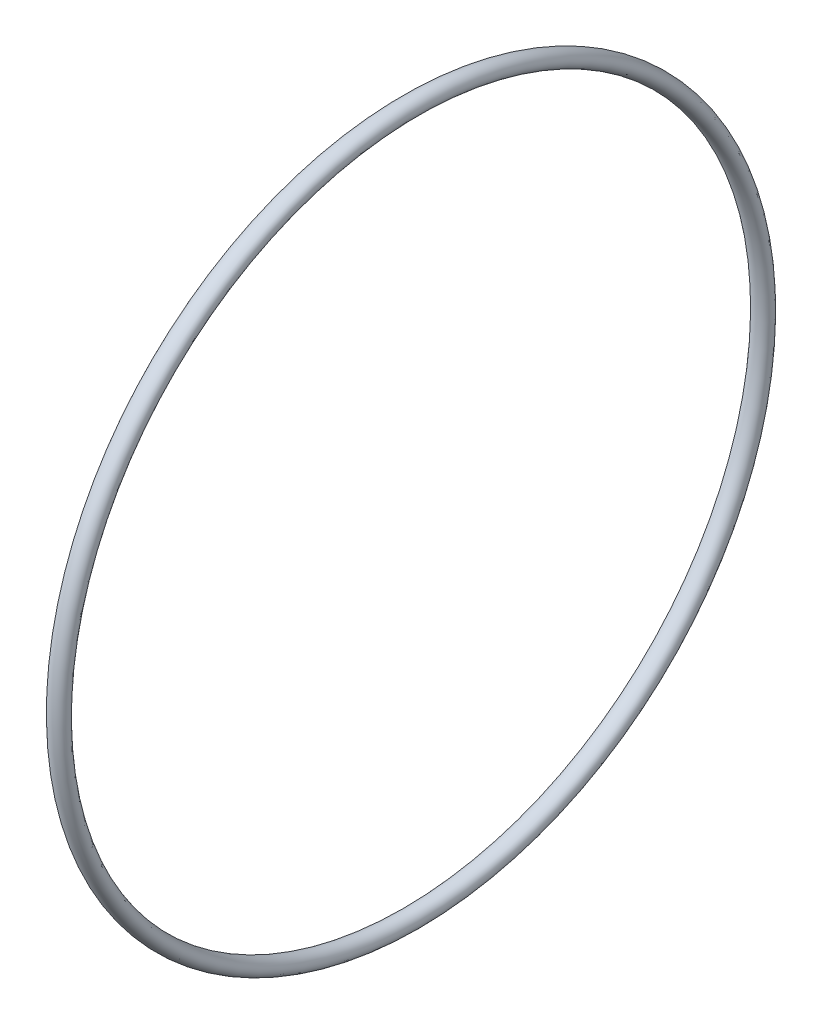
ISO-10303-21;
HEADER;
FILE_DESCRIPTION(('STEP AP214'),'2;1');
FILE_NAME('part.step','',(''),(''),'','','');
FILE_SCHEMA(('AUTOMOTIVE_DESIGN { 1 0 10303 214 1 1 1 1 }'));
ENDSEC;
DATA;
#1=APPLICATION_CONTEXT('core data for automotive mechanical design processes');
#2=APPLICATION_PROTOCOL_DEFINITION('international standard','automotive_design',2000,#1);
#3=PRODUCT_CONTEXT('',#1,'mechanical');
#4=PRODUCT('Part','Part','',(#3));
#5=PRODUCT_RELATED_PRODUCT_CATEGORY('part','',(#4));
#6=PRODUCT_DEFINITION_FORMATION('','',#4);
#7=PRODUCT_DEFINITION_CONTEXT('part definition',#1,'design');
#8=PRODUCT_DEFINITION('design','',#6,#7);
#9=PRODUCT_DEFINITION_SHAPE('','',#8);
#10=(LENGTH_UNIT() NAMED_UNIT(*) SI_UNIT(.MILLI.,.METRE.));
#11=(NAMED_UNIT(*) PLANE_ANGLE_UNIT() SI_UNIT($,.RADIAN.));
#12=(NAMED_UNIT(*) SI_UNIT($,.STERADIAN.) SOLID_ANGLE_UNIT());
#13=UNCERTAINTY_MEASURE_WITH_UNIT(LENGTH_MEASURE(1.E-05),#10,'distance_accuracy_value','');
#14=(GEOMETRIC_REPRESENTATION_CONTEXT(3) GLOBAL_UNCERTAINTY_ASSIGNED_CONTEXT((#13)) GLOBAL_UNIT_ASSIGNED_CONTEXT((#10,
#11,#12)) REPRESENTATION_CONTEXT('',''));
#15=CARTESIAN_POINT('',(0.,0.,0.));
#16=DIRECTION('',(0.,0.,1.));
#17=DIRECTION('',(1.,0.,0.));
#18=AXIS2_PLACEMENT_3D('',#15,#16,#17);
#19=CARTESIAN_POINT('',(0.,-92.9,6.48717232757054E-13));
#20=DIRECTION('',(0.,0.,-1.));
#21=DIRECTION('',(-1.,0.,0.));
#22=AXIS2_PLACEMENT_3D('',#19,#20,#21);
#23=ELLIPSE('',#22,2.6,2.05);
#24=CARTESIAN_POINT('',(-22.4760373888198,0.,0.));
#25=DIRECTION('',(-1.,0.,0.));
#26=AXIS1_PLACEMENT('',#24,#25);
#27=SURFACE_OF_REVOLUTION('',#23,#26);
#28=ADVANCED_FACE('F27',(),#27,.T.);
#29=CLOSED_SHELL('',(#28));
#30=MANIFOLD_SOLID_BREP('B2',#29);
#31=ADVANCED_BREP_SHAPE_REPRESENTATION('',(#18,#30),#14);
#32=SHAPE_DEFINITION_REPRESENTATION(#9,#31);
ENDSEC;
END-ISO-10303-21;
